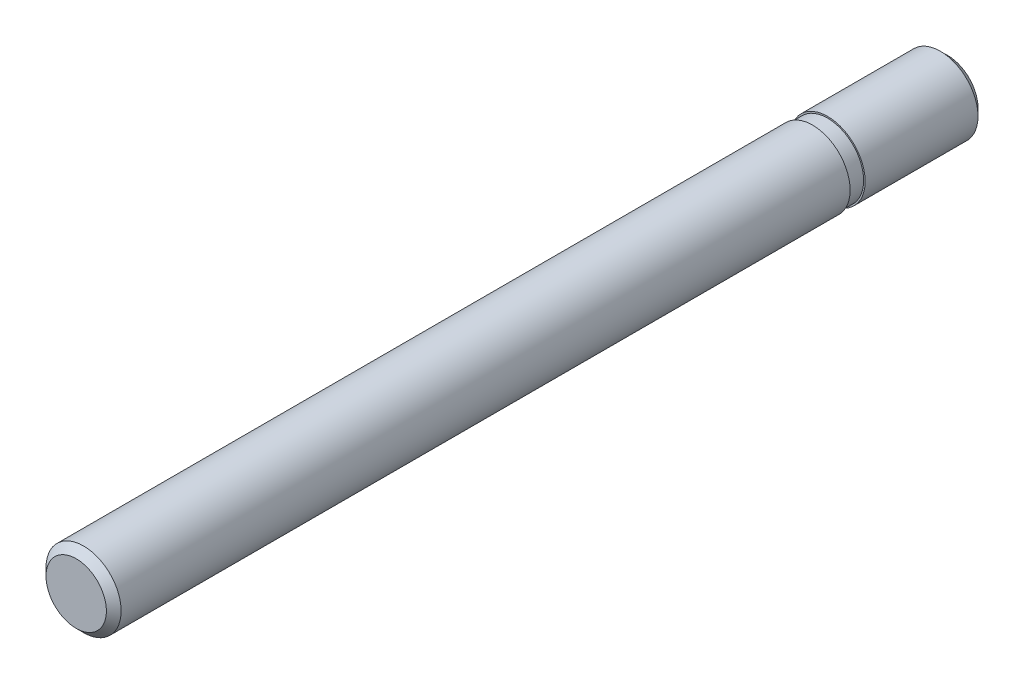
ISO-10303-21;
HEADER;
FILE_DESCRIPTION(('STEP AP214'),'2;1');
FILE_NAME('part.step','',(''),(''),'','','');
FILE_SCHEMA(('AUTOMOTIVE_DESIGN { 1 0 10303 214 1 1 1 1 }'));
ENDSEC;
DATA;
#1=APPLICATION_CONTEXT('core data for automotive mechanical design processes');
#2=APPLICATION_PROTOCOL_DEFINITION('international standard','automotive_design',2000,#1);
#3=PRODUCT_CONTEXT('',#1,'mechanical');
#4=PRODUCT('Part','Part','',(#3));
#5=PRODUCT_RELATED_PRODUCT_CATEGORY('part','',(#4));
#6=PRODUCT_DEFINITION_FORMATION('','',#4);
#7=PRODUCT_DEFINITION_CONTEXT('part definition',#1,'design');
#8=PRODUCT_DEFINITION('design','',#6,#7);
#9=PRODUCT_DEFINITION_SHAPE('','',#8);
#10=(LENGTH_UNIT() NAMED_UNIT(*) SI_UNIT(.MILLI.,.METRE.));
#11=(NAMED_UNIT(*) PLANE_ANGLE_UNIT() SI_UNIT($,.RADIAN.));
#12=(NAMED_UNIT(*) SI_UNIT($,.STERADIAN.) SOLID_ANGLE_UNIT());
#13=UNCERTAINTY_MEASURE_WITH_UNIT(LENGTH_MEASURE(1.E-05),#10,'distance_accuracy_value','');
#14=(GEOMETRIC_REPRESENTATION_CONTEXT(3) GLOBAL_UNCERTAINTY_ASSIGNED_CONTEXT((#13)) GLOBAL_UNIT_ASSIGNED_CONTEXT((#10,
#11,#12)) REPRESENTATION_CONTEXT('',''));
#15=CARTESIAN_POINT('',(0.,0.,0.));
#16=DIRECTION('',(0.,0.,1.));
#17=DIRECTION('',(1.,0.,0.));
#18=AXIS2_PLACEMENT_3D('',#15,#16,#17);
#19=CARTESIAN_POINT('',(0.,1.00475,-8.));
#20=DIRECTION('',(0.,0.,-1.));
#21=DIRECTION('',(-1.,0.,0.));
#22=AXIS2_PLACEMENT_3D('',#19,#20,#21);
#23=PLANE('',#22);
#24=CARTESIAN_POINT('',(0.,0.,-8.00000000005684));
#25=DIRECTION('',(0.,0.,1.));
#26=DIRECTION('',(1.,0.,0.));
#27=AXIS2_PLACEMENT_3D('',#24,#25,#26);
#28=CIRCLE('',#27,2.00949999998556);
#29=CARTESIAN_POINT('',(2.00949999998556,0.,-8.00000000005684));
#30=VERTEX_POINT('',#29);
#31=EDGE_CURVE('E19',#30,#30,#28,.T.);
#32=ORIENTED_EDGE('',*,*,#31,.F.);
#33=EDGE_LOOP('',(#32));
#34=FACE_BOUND('',#33,.T.);
#35=ADVANCED_FACE('F12',(#34),#23,.T.);
#36=CARTESIAN_POINT('',(0.,0.,-7.50950000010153));
#37=DIRECTION('',(0.,0.,1.));
#38=DIRECTION('',(1.,0.,0.));
#39=AXIS2_PLACEMENT_3D('',#36,#37,#38);
#40=CONICAL_SURFACE('',#39,2.49999999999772,0.785398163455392);
#41=CARTESIAN_POINT('',(0.,0.,-7.5095));
#42=DIRECTION('',(0.,0.,1.));
#43=DIRECTION('',(1.,0.,0.));
#44=AXIS2_PLACEMENT_3D('',#41,#42,#43);
#45=CIRCLE('',#44,2.5);
#46=CARTESIAN_POINT('',(2.5,0.,-7.5095));
#47=VERTEX_POINT('',#46);
#48=EDGE_CURVE('E23',#47,#47,#45,.T.);
#49=ORIENTED_EDGE('',*,*,#48,.F.);
#50=EDGE_LOOP('',(#49));
#51=FACE_BOUND('',#50,.T.);
#52=ORIENTED_EDGE('',*,*,#31,.T.);
#53=EDGE_LOOP('',(#52));
#54=FACE_BOUND('',#53,.T.);
#55=ADVANCED_FACE('F64',(#51,#54),#40,.T.);
#56=CARTESIAN_POINT('',(0.,0.,6.5));
#57=DIRECTION('',(0.,0.,1.));
#58=DIRECTION('',(1.,0.,0.));
#59=AXIS2_PLACEMENT_3D('',#56,#57,#58);
#60=CYLINDRICAL_SURFACE('',#59,2.5);
#61=CARTESIAN_POINT('',(0.,0.,0.));
#62=DIRECTION('',(0.,0.,1.));
#63=DIRECTION('',(1.,0.,0.));
#64=AXIS2_PLACEMENT_3D('',#61,#62,#63);
#65=CIRCLE('',#64,2.5);
#66=CARTESIAN_POINT('',(2.5,0.,0.));
#67=VERTEX_POINT('',#66);
#68=EDGE_CURVE('E28',#67,#67,#65,.T.);
#69=ORIENTED_EDGE('',*,*,#68,.F.);
#70=EDGE_LOOP('',(#69));
#71=FACE_BOUND('',#70,.T.);
#72=ORIENTED_EDGE('',*,*,#48,.T.);
#73=EDGE_LOOP('',(#72));
#74=FACE_BOUND('',#73,.T.);
#75=ADVANCED_FACE('F70',(#71,#74),#60,.T.);
#76=CARTESIAN_POINT('',(0.,0.,0.));
#77=DIRECTION('',(0.,0.,1.));
#78=DIRECTION('',(1.,0.,0.));
#79=AXIS2_PLACEMENT_3D('',#76,#77,#78);
#80=PLANE('',#79);
#81=CARTESIAN_POINT('',(0.,0.,0.));
#82=DIRECTION('',(0.,0.,1.));
#83=DIRECTION('',(1.,0.,0.));
#84=AXIS2_PLACEMENT_3D('',#81,#82,#83);
#85=CIRCLE('',#84,2.4);
#86=CARTESIAN_POINT('',(2.4,0.,0.));
#87=VERTEX_POINT('',#86);
#88=EDGE_CURVE('E8',#87,#87,#85,.T.);
#89=ORIENTED_EDGE('',*,*,#88,.F.);
#90=EDGE_LOOP('',(#89));
#91=FACE_BOUND('',#90,.T.);
#92=ORIENTED_EDGE('',*,*,#68,.T.);
#93=EDGE_LOOP('',(#92));
#94=FACE_BOUND('',#93,.T.);
#95=ADVANCED_FACE('F75',(#91,#94),#80,.T.);
#96=CARTESIAN_POINT('',(0.,0.,-1.92725192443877));
#97=DIRECTION('',(0.,0.,-1.));
#98=DIRECTION('',(-1.,0.,0.));
#99=AXIS2_PLACEMENT_3D('',#96,#97,#98);
#100=CYLINDRICAL_SURFACE('',#99,2.4);
#101=CARTESIAN_POINT('',(0.,0.,1.));
#102=DIRECTION('',(0.,0.,-1.));
#103=DIRECTION('',(-1.,0.,0.));
#104=AXIS2_PLACEMENT_3D('',#101,#102,#103);
#105=CIRCLE('',#104,2.4);
#106=CARTESIAN_POINT('',(-2.4,0.,1.));
#107=VERTEX_POINT('',#106);
#108=EDGE_CURVE('E44',#107,#107,#105,.T.);
#109=ORIENTED_EDGE('',*,*,#108,.T.);
#110=EDGE_LOOP('',(#109));
#111=FACE_BOUND('',#110,.T.);
#112=ORIENTED_EDGE('',*,*,#88,.T.);
#113=EDGE_LOOP('',(#112));
#114=FACE_BOUND('',#113,.T.);
#115=ADVANCED_FACE('F49',(#111,#114),#100,.T.);
#116=CARTESIAN_POINT('',(0.,1.00475,50.));
#117=DIRECTION('',(0.,0.,1.));
#118=DIRECTION('',(1.,0.,0.));
#119=AXIS2_PLACEMENT_3D('',#116,#117,#118);
#120=PLANE('',#119);
#121=CARTESIAN_POINT('',(0.,0.,50.0000000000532));
#122=DIRECTION('',(0.,0.,-1.));
#123=DIRECTION('',(-1.,0.,0.));
#124=AXIS2_PLACEMENT_3D('',#121,#122,#123);
#125=CIRCLE('',#124,2.00949999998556);
#126=CARTESIAN_POINT('',(-2.00949999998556,0.,50.0000000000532));
#127=VERTEX_POINT('',#126);
#128=EDGE_CURVE('E31',#127,#127,#125,.T.);
#129=ORIENTED_EDGE('',*,*,#128,.F.);
#130=EDGE_LOOP('',(#129));
#131=FACE_BOUND('',#130,.T.);
#132=ADVANCED_FACE('F83',(#131),#120,.T.);
#133=CARTESIAN_POINT('',(0.,0.,49.509500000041));
#134=DIRECTION('',(0.,0.,-1.));
#135=DIRECTION('',(-1.,0.,0.));
#136=AXIS2_PLACEMENT_3D('',#133,#134,#135);
#137=CONICAL_SURFACE('',#136,2.50000000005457,0.785398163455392);
#138=ORIENTED_EDGE('',*,*,#128,.T.);
#139=EDGE_LOOP('',(#138));
#140=FACE_BOUND('',#139,.T.);
#141=CARTESIAN_POINT('',(0.,0.,49.5095));
#142=DIRECTION('',(0.,0.,1.));
#143=DIRECTION('',(1.,0.,0.));
#144=AXIS2_PLACEMENT_3D('',#141,#142,#143);
#145=CIRCLE('',#144,2.5);
#146=CARTESIAN_POINT('',(2.5,0.,49.5095));
#147=VERTEX_POINT('',#146);
#148=EDGE_CURVE('E37',#147,#147,#145,.F.);
#149=ORIENTED_EDGE('',*,*,#148,.F.);
#150=EDGE_LOOP('',(#149));
#151=FACE_BOUND('',#150,.T.);
#152=ADVANCED_FACE('F60',(#140,#151),#137,.T.);
#153=CARTESIAN_POINT('',(0.,0.,6.5));
#154=DIRECTION('',(0.,0.,1.));
#155=DIRECTION('',(1.,0.,0.));
#156=AXIS2_PLACEMENT_3D('',#153,#154,#155);
#157=CYLINDRICAL_SURFACE('',#156,2.5);
#158=CARTESIAN_POINT('',(0.,0.,1.));
#159=DIRECTION('',(0.,0.,1.));
#160=DIRECTION('',(1.,0.,0.));
#161=AXIS2_PLACEMENT_3D('',#158,#159,#160);
#162=CIRCLE('',#161,2.5);
#163=CARTESIAN_POINT('',(2.5,0.,1.));
#164=VERTEX_POINT('',#163);
#165=EDGE_CURVE('E35',#164,#164,#162,.T.);
#166=ORIENTED_EDGE('',*,*,#165,.T.);
#167=EDGE_LOOP('',(#166));
#168=FACE_BOUND('',#167,.T.);
#169=ORIENTED_EDGE('',*,*,#148,.T.);
#170=EDGE_LOOP('',(#169));
#171=FACE_BOUND('',#170,.T.);
#172=ADVANCED_FACE('F14',(#168,#171),#157,.T.);
#173=CARTESIAN_POINT('',(0.,0.,1.));
#174=DIRECTION('',(0.,0.,1.));
#175=DIRECTION('',(1.,0.,0.));
#176=AXIS2_PLACEMENT_3D('',#173,#174,#175);
#177=PLANE('',#176);
#178=ORIENTED_EDGE('',*,*,#108,.F.);
#179=EDGE_LOOP('',(#178));
#180=FACE_BOUND('',#179,.T.);
#181=ORIENTED_EDGE('',*,*,#165,.F.);
#182=EDGE_LOOP('',(#181));
#183=FACE_BOUND('',#182,.T.);
#184=ADVANCED_FACE('F51',(#180,#183),#177,.F.);
#185=CLOSED_SHELL('',(#35,#55,#75,#95,#115,#132,#152,#172,#184));
#186=MANIFOLD_SOLID_BREP('B1',#185);
#187=ADVANCED_BREP_SHAPE_REPRESENTATION('',(#18,#186),#14);
#188=SHAPE_DEFINITION_REPRESENTATION(#9,#187);
ENDSEC;
END-ISO-10303-21;
